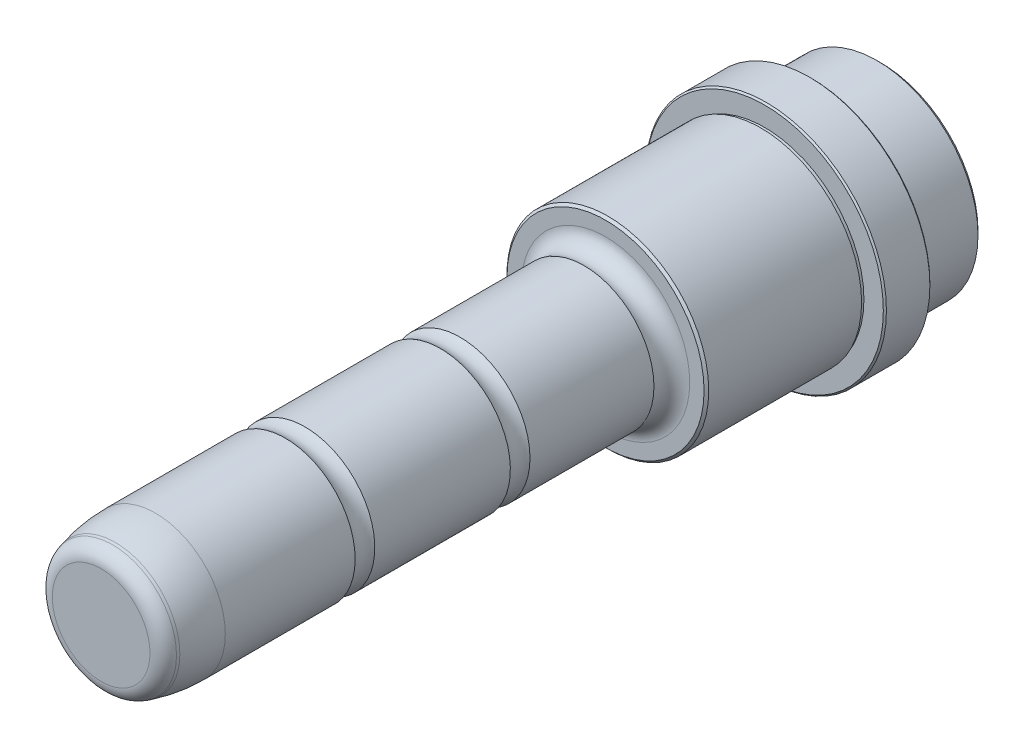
ISO-10303-21;
HEADER;
FILE_DESCRIPTION(('STEP AP214'),'2;1');
FILE_NAME('part.step','',(''),(''),'','','');
FILE_SCHEMA(('AUTOMOTIVE_DESIGN { 1 0 10303 214 1 1 1 1 }'));
ENDSEC;
DATA;
#1=APPLICATION_CONTEXT('core data for automotive mechanical design processes');
#2=APPLICATION_PROTOCOL_DEFINITION('international standard','automotive_design',2000,#1);
#3=PRODUCT_CONTEXT('',#1,'mechanical');
#4=PRODUCT('Part','Part','',(#3));
#5=PRODUCT_RELATED_PRODUCT_CATEGORY('part','',(#4));
#6=PRODUCT_DEFINITION_FORMATION('','',#4);
#7=PRODUCT_DEFINITION_CONTEXT('part definition',#1,'design');
#8=PRODUCT_DEFINITION('design','',#6,#7);
#9=PRODUCT_DEFINITION_SHAPE('','',#8);
#10=(LENGTH_UNIT() NAMED_UNIT(*) SI_UNIT(.MILLI.,.METRE.));
#11=(NAMED_UNIT(*) PLANE_ANGLE_UNIT() SI_UNIT($,.RADIAN.));
#12=(NAMED_UNIT(*) SI_UNIT($,.STERADIAN.) SOLID_ANGLE_UNIT());
#13=UNCERTAINTY_MEASURE_WITH_UNIT(LENGTH_MEASURE(1.E-05),#10,'distance_accuracy_value','');
#14=(GEOMETRIC_REPRESENTATION_CONTEXT(3) GLOBAL_UNCERTAINTY_ASSIGNED_CONTEXT((#13)) GLOBAL_UNIT_ASSIGNED_CONTEXT((#10,
#11,#12)) REPRESENTATION_CONTEXT('',''));
#15=CARTESIAN_POINT('',(0.,0.,0.));
#16=DIRECTION('',(0.,0.,1.));
#17=DIRECTION('',(1.,0.,0.));
#18=AXIS2_PLACEMENT_3D('',#15,#16,#17);
#19=CARTESIAN_POINT('',(0.,0.,-8.74999999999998));
#20=DIRECTION('',(0.,0.,1.));
#21=DIRECTION('',(1.,0.,0.));
#22=AXIS2_PLACEMENT_3D('',#19,#20,#21);
#23=CYLINDRICAL_SURFACE('',#22,9.);
#24=CARTESIAN_POINT('',(0.,0.,29.5099342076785));
#25=DIRECTION('',(0.,0.,1.));
#26=DIRECTION('',(1.,0.,0.));
#27=AXIS2_PLACEMENT_3D('',#24,#25,#26);
#28=CIRCLE('',#27,9.);
#29=CARTESIAN_POINT('',(9.,0.,29.5099342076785));
#30=VERTEX_POINT('',#29);
#31=EDGE_CURVE('E10',#30,#30,#28,.T.);
#32=ORIENTED_EDGE('',*,*,#31,.T.);
#33=EDGE_LOOP('',(#32));
#34=FACE_BOUND('',#33,.T.);
#35=CARTESIAN_POINT('',(0.,0.,45.4850889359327));
#36=DIRECTION('',(0.,0.,1.));
#37=DIRECTION('',(0.,-1.,0.));
#38=AXIS2_PLACEMENT_3D('',#35,#36,#37);
#39=CIRCLE('',#38,9.);
#40=CARTESIAN_POINT('',(0.,-9.,45.4850889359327));
#41=VERTEX_POINT('',#40);
#42=EDGE_CURVE('E106',#41,#41,#39,.T.);
#43=ORIENTED_EDGE('',*,*,#42,.F.);
#44=EDGE_LOOP('',(#43));
#45=FACE_BOUND('',#44,.T.);
#46=ADVANCED_FACE('F32',(#34,#45),#23,.T.);
#47=CARTESIAN_POINT('',(0.,0.,28.75));
#48=DIRECTION('',(0.,0.,1.));
#49=DIRECTION('',(1.,0.,0.));
#50=AXIS2_PLACEMENT_3D('',#47,#48,#49);
#51=TOROIDAL_SURFACE('',#50,10.85,2.);
#52=ORIENTED_EDGE('',*,*,#31,.F.);
#53=EDGE_LOOP('',(#52));
#54=FACE_BOUND('',#53,.T.);
#55=CARTESIAN_POINT('',(0.,0.,26.75));
#56=DIRECTION('',(0.,0.,1.));
#57=DIRECTION('',(1.,0.,0.));
#58=AXIS2_PLACEMENT_3D('',#55,#56,#57);
#59=CIRCLE('',#58,10.85);
#60=CARTESIAN_POINT('',(10.85,0.,26.75));
#61=VERTEX_POINT('',#60);
#62=EDGE_CURVE('E97',#61,#61,#59,.T.);
#63=ORIENTED_EDGE('',*,*,#62,.T.);
#64=EDGE_LOOP('',(#63));
#65=FACE_BOUND('',#64,.T.);
#66=ADVANCED_FACE('F34',(#54,#65),#51,.F.);
#67=CARTESIAN_POINT('',(0.,0.,-8.74999999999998));
#68=DIRECTION('',(0.,0.,1.));
#69=DIRECTION('',(1.,0.,0.));
#70=AXIS2_PLACEMENT_3D('',#67,#68,#69);
#71=PLANE('',#70);
#72=CARTESIAN_POINT('',(0.,0.,-8.74999999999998));
#73=DIRECTION('',(0.,0.,1.));
#74=DIRECTION('',(1.,0.,0.));
#75=AXIS2_PLACEMENT_3D('',#72,#73,#74);
#76=CIRCLE('',#75,12.5);
#77=CARTESIAN_POINT('',(12.5,0.,-8.74999999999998));
#78=VERTEX_POINT('',#77);
#79=EDGE_CURVE('E55',#78,#78,#76,.T.);
#80=ORIENTED_EDGE('',*,*,#79,.F.);
#81=EDGE_LOOP('',(#80));
#82=FACE_BOUND('',#81,.T.);
#83=ADVANCED_FACE('F137',(#82),#71,.F.);
#84=CARTESIAN_POINT('',(0.,0.,-8.74999999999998));
#85=DIRECTION('',(0.,0.,1.));
#86=DIRECTION('',(1.,0.,0.));
#87=AXIS2_PLACEMENT_3D('',#84,#85,#86);
#88=CONICAL_SURFACE('',#87,12.5,0.785398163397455);
#89=CARTESIAN_POINT('',(0.,0.,-8.24999999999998));
#90=DIRECTION('',(0.,0.,1.));
#91=DIRECTION('',(1.,0.,0.));
#92=AXIS2_PLACEMENT_3D('',#89,#90,#91);
#93=CIRCLE('',#92,13.);
#94=CARTESIAN_POINT('',(13.,0.,-8.24999999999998));
#95=VERTEX_POINT('',#94);
#96=EDGE_CURVE('E58',#95,#95,#93,.T.);
#97=ORIENTED_EDGE('',*,*,#96,.F.);
#98=EDGE_LOOP('',(#97));
#99=FACE_BOUND('',#98,.T.);
#100=ORIENTED_EDGE('',*,*,#79,.T.);
#101=EDGE_LOOP('',(#100));
#102=FACE_BOUND('',#101,.T.);
#103=ADVANCED_FACE('F204',(#99,#102),#88,.T.);
#104=CARTESIAN_POINT('',(0.,0.,-8.74999999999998));
#105=DIRECTION('',(0.,0.,1.));
#106=DIRECTION('',(1.,0.,0.));
#107=AXIS2_PLACEMENT_3D('',#104,#105,#106);
#108=CYLINDRICAL_SURFACE('',#107,13.);
#109=CARTESIAN_POINT('',(0.,0.,-0.249999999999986));
#110=DIRECTION('',(0.,0.,1.));
#111=DIRECTION('',(1.,0.,0.));
#112=AXIS2_PLACEMENT_3D('',#109,#110,#111);
#113=CIRCLE('',#112,13.);
#114=CARTESIAN_POINT('',(13.,0.,-0.249999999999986));
#115=VERTEX_POINT('',#114);
#116=EDGE_CURVE('E61',#115,#115,#113,.T.);
#117=ORIENTED_EDGE('',*,*,#116,.F.);
#118=EDGE_LOOP('',(#117));
#119=FACE_BOUND('',#118,.T.);
#120=ORIENTED_EDGE('',*,*,#96,.T.);
#121=EDGE_LOOP('',(#120));
#122=FACE_BOUND('',#121,.T.);
#123=ADVANCED_FACE('F200',(#119,#122),#108,.T.);
#124=CARTESIAN_POINT('',(0.,13.,-0.249999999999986));
#125=DIRECTION('',(0.,0.,-1.));
#126=DIRECTION('',(-1.,0.,0.));
#127=AXIS2_PLACEMENT_3D('',#124,#125,#126);
#128=PLANE('',#127);
#129=CARTESIAN_POINT('',(0.,0.,-0.249999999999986));
#130=DIRECTION('',(0.,0.,1.));
#131=DIRECTION('',(1.,0.,0.));
#132=AXIS2_PLACEMENT_3D('',#129,#130,#131);
#133=CIRCLE('',#132,12.8);
#134=CARTESIAN_POINT('',(12.8,0.,-0.249999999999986));
#135=VERTEX_POINT('',#134);
#136=EDGE_CURVE('E64',#135,#135,#133,.T.);
#137=ORIENTED_EDGE('',*,*,#136,.F.);
#138=EDGE_LOOP('',(#137));
#139=FACE_BOUND('',#138,.T.);
#140=ORIENTED_EDGE('',*,*,#116,.T.);
#141=EDGE_LOOP('',(#140));
#142=FACE_BOUND('',#141,.T.);
#143=ADVANCED_FACE('F196',(#139,#142),#128,.F.);
#144=CARTESIAN_POINT('',(0.,0.,-8.74999999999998));
#145=DIRECTION('',(0.,0.,1.));
#146=DIRECTION('',(1.,0.,0.));
#147=AXIS2_PLACEMENT_3D('',#144,#145,#146);
#148=CYLINDRICAL_SURFACE('',#147,12.8);
#149=CARTESIAN_POINT('',(0.,0.,0.250000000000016));
#150=DIRECTION('',(0.,0.,1.));
#151=DIRECTION('',(1.,0.,0.));
#152=AXIS2_PLACEMENT_3D('',#149,#150,#151);
#153=CIRCLE('',#152,12.8);
#154=CARTESIAN_POINT('',(12.8,0.,0.250000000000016));
#155=VERTEX_POINT('',#154);
#156=EDGE_CURVE('E67',#155,#155,#153,.T.);
#157=ORIENTED_EDGE('',*,*,#156,.F.);
#158=EDGE_LOOP('',(#157));
#159=FACE_BOUND('',#158,.T.);
#160=ORIENTED_EDGE('',*,*,#136,.T.);
#161=EDGE_LOOP('',(#160));
#162=FACE_BOUND('',#161,.T.);
#163=ADVANCED_FACE('F192',(#159,#162),#148,.T.);
#164=CARTESIAN_POINT('',(0.,12.8,0.250000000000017));
#165=DIRECTION('',(0.,0.,1.));
#166=DIRECTION('',(1.,0.,0.));
#167=AXIS2_PLACEMENT_3D('',#164,#165,#166);
#168=PLANE('',#167);
#169=CARTESIAN_POINT('',(0.,0.,0.250000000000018));
#170=DIRECTION('',(0.,0.,1.));
#171=DIRECTION('',(1.,0.,0.));
#172=AXIS2_PLACEMENT_3D('',#169,#170,#171);
#173=CIRCLE('',#172,15.3);
#174=CARTESIAN_POINT('',(15.3,0.,0.250000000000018));
#175=VERTEX_POINT('',#174);
#176=EDGE_CURVE('E70',#175,#175,#173,.T.);
#177=ORIENTED_EDGE('',*,*,#176,.F.);
#178=EDGE_LOOP('',(#177));
#179=FACE_BOUND('',#178,.T.);
#180=ORIENTED_EDGE('',*,*,#156,.T.);
#181=EDGE_LOOP('',(#180));
#182=FACE_BOUND('',#181,.T.);
#183=ADVANCED_FACE('F188',(#179,#182),#168,.F.);
#184=CARTESIAN_POINT('',(0.,0.,0.250000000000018));
#185=DIRECTION('',(0.,0.,1.));
#186=DIRECTION('',(1.,0.,0.));
#187=AXIS2_PLACEMENT_3D('',#184,#185,#186);
#188=CONICAL_SURFACE('',#187,15.3,0.785398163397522);
#189=CARTESIAN_POINT('',(0.,0.,0.450000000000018));
#190=DIRECTION('',(0.,0.,1.));
#191=DIRECTION('',(1.,0.,0.));
#192=AXIS2_PLACEMENT_3D('',#189,#190,#191);
#193=CIRCLE('',#192,15.5);
#194=CARTESIAN_POINT('',(15.5,0.,0.450000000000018));
#195=VERTEX_POINT('',#194);
#196=EDGE_CURVE('E73',#195,#195,#193,.T.);
#197=ORIENTED_EDGE('',*,*,#196,.F.);
#198=EDGE_LOOP('',(#197));
#199=FACE_BOUND('',#198,.T.);
#200=ORIENTED_EDGE('',*,*,#176,.T.);
#201=EDGE_LOOP('',(#200));
#202=FACE_BOUND('',#201,.T.);
#203=ADVANCED_FACE('F184',(#199,#202),#188,.T.);
#204=CARTESIAN_POINT('',(0.,0.,-8.74999999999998));
#205=DIRECTION('',(0.,0.,1.));
#206=DIRECTION('',(1.,0.,0.));
#207=AXIS2_PLACEMENT_3D('',#204,#205,#206);
#208=CYLINDRICAL_SURFACE('',#207,15.5);
#209=CARTESIAN_POINT('',(0.,0.,6.05000000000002));
#210=DIRECTION('',(0.,0.,1.));
#211=DIRECTION('',(1.,0.,0.));
#212=AXIS2_PLACEMENT_3D('',#209,#210,#211);
#213=CIRCLE('',#212,15.5);
#214=CARTESIAN_POINT('',(15.5,0.,6.05000000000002));
#215=VERTEX_POINT('',#214);
#216=EDGE_CURVE('E76',#215,#215,#213,.T.);
#217=ORIENTED_EDGE('',*,*,#216,.F.);
#218=EDGE_LOOP('',(#217));
#219=FACE_BOUND('',#218,.T.);
#220=ORIENTED_EDGE('',*,*,#196,.T.);
#221=EDGE_LOOP('',(#220));
#222=FACE_BOUND('',#221,.T.);
#223=ADVANCED_FACE('F180',(#219,#222),#208,.T.);
#224=CARTESIAN_POINT('',(0.,0.,6.05000000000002));
#225=DIRECTION('',(0.,0.,-1.));
#226=DIRECTION('',(-1.,0.,0.));
#227=AXIS2_PLACEMENT_3D('',#224,#225,#226);
#228=CONICAL_SURFACE('',#227,15.5,0.785398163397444);
#229=CARTESIAN_POINT('',(0.,0.,6.25000000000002));
#230=DIRECTION('',(0.,0.,1.));
#231=DIRECTION('',(1.,0.,0.));
#232=AXIS2_PLACEMENT_3D('',#229,#230,#231);
#233=CIRCLE('',#232,15.3);
#234=CARTESIAN_POINT('',(15.3,0.,6.25000000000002));
#235=VERTEX_POINT('',#234);
#236=EDGE_CURVE('E79',#235,#235,#233,.T.);
#237=ORIENTED_EDGE('',*,*,#236,.F.);
#238=EDGE_LOOP('',(#237));
#239=FACE_BOUND('',#238,.T.);
#240=ORIENTED_EDGE('',*,*,#216,.T.);
#241=EDGE_LOOP('',(#240));
#242=FACE_BOUND('',#241,.T.);
#243=ADVANCED_FACE('F176',(#239,#242),#228,.T.);
#244=CARTESIAN_POINT('',(0.,15.3,6.25000000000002));
#245=DIRECTION('',(0.,0.,-1.));
#246=DIRECTION('',(-1.,0.,0.));
#247=AXIS2_PLACEMENT_3D('',#244,#245,#246);
#248=PLANE('',#247);
#249=CARTESIAN_POINT('',(0.,0.,6.25000000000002));
#250=DIRECTION('',(0.,0.,1.));
#251=DIRECTION('',(1.,0.,0.));
#252=AXIS2_PLACEMENT_3D('',#249,#250,#251);
#253=CIRCLE('',#252,12.8);
#254=CARTESIAN_POINT('',(12.8,0.,6.25000000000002));
#255=VERTEX_POINT('',#254);
#256=EDGE_CURVE('E82',#255,#255,#253,.T.);
#257=ORIENTED_EDGE('',*,*,#256,.F.);
#258=EDGE_LOOP('',(#257));
#259=FACE_BOUND('',#258,.T.);
#260=ORIENTED_EDGE('',*,*,#236,.T.);
#261=EDGE_LOOP('',(#260));
#262=FACE_BOUND('',#261,.T.);
#263=ADVANCED_FACE('F172',(#259,#262),#248,.F.);
#264=CARTESIAN_POINT('',(0.,0.,-8.74999999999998));
#265=DIRECTION('',(0.,0.,1.));
#266=DIRECTION('',(1.,0.,0.));
#267=AXIS2_PLACEMENT_3D('',#264,#265,#266);
#268=CYLINDRICAL_SURFACE('',#267,12.8);
#269=CARTESIAN_POINT('',(0.,0.,6.75000000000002));
#270=DIRECTION('',(0.,0.,1.));
#271=DIRECTION('',(1.,0.,0.));
#272=AXIS2_PLACEMENT_3D('',#269,#270,#271);
#273=CIRCLE('',#272,12.8);
#274=CARTESIAN_POINT('',(12.8,0.,6.75000000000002));
#275=VERTEX_POINT('',#274);
#276=EDGE_CURVE('E85',#275,#275,#273,.T.);
#277=ORIENTED_EDGE('',*,*,#276,.F.);
#278=EDGE_LOOP('',(#277));
#279=FACE_BOUND('',#278,.T.);
#280=ORIENTED_EDGE('',*,*,#256,.T.);
#281=EDGE_LOOP('',(#280));
#282=FACE_BOUND('',#281,.T.);
#283=ADVANCED_FACE('F168',(#279,#282),#268,.T.);
#284=CARTESIAN_POINT('',(0.,12.8,6.75000000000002));
#285=DIRECTION('',(0.,0.,1.));
#286=DIRECTION('',(1.,0.,0.));
#287=AXIS2_PLACEMENT_3D('',#284,#285,#286);
#288=PLANE('',#287);
#289=CARTESIAN_POINT('',(0.,0.,6.75000000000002));
#290=DIRECTION('',(0.,0.,1.));
#291=DIRECTION('',(1.,0.,0.));
#292=AXIS2_PLACEMENT_3D('',#289,#290,#291);
#293=CIRCLE('',#292,13.);
#294=CARTESIAN_POINT('',(13.,0.,6.75000000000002));
#295=VERTEX_POINT('',#294);
#296=EDGE_CURVE('E88',#295,#295,#293,.T.);
#297=ORIENTED_EDGE('',*,*,#296,.F.);
#298=EDGE_LOOP('',(#297));
#299=FACE_BOUND('',#298,.T.);
#300=ORIENTED_EDGE('',*,*,#276,.T.);
#301=EDGE_LOOP('',(#300));
#302=FACE_BOUND('',#301,.T.);
#303=ADVANCED_FACE('F164',(#299,#302),#288,.F.);
#304=CARTESIAN_POINT('',(0.,0.,-8.74999999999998));
#305=DIRECTION('',(0.,0.,1.));
#306=DIRECTION('',(1.,0.,0.));
#307=AXIS2_PLACEMENT_3D('',#304,#305,#306);
#308=CYLINDRICAL_SURFACE('',#307,13.);
#309=CARTESIAN_POINT('',(0.,0.,26.45));
#310=DIRECTION('',(0.,0.,1.));
#311=DIRECTION('',(1.,0.,0.));
#312=AXIS2_PLACEMENT_3D('',#309,#310,#311);
#313=CIRCLE('',#312,13.);
#314=CARTESIAN_POINT('',(13.,0.,26.45));
#315=VERTEX_POINT('',#314);
#316=EDGE_CURVE('E91',#315,#315,#313,.T.);
#317=ORIENTED_EDGE('',*,*,#316,.F.);
#318=EDGE_LOOP('',(#317));
#319=FACE_BOUND('',#318,.T.);
#320=ORIENTED_EDGE('',*,*,#296,.T.);
#321=EDGE_LOOP('',(#320));
#322=FACE_BOUND('',#321,.T.);
#323=ADVANCED_FACE('F160',(#319,#322),#308,.T.);
#324=CARTESIAN_POINT('',(0.,0.,26.45));
#325=DIRECTION('',(0.,0.,-1.));
#326=DIRECTION('',(-1.,0.,0.));
#327=AXIS2_PLACEMENT_3D('',#324,#325,#326);
#328=CONICAL_SURFACE('',#327,13.,0.785398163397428);
#329=CARTESIAN_POINT('',(0.,0.,26.75));
#330=DIRECTION('',(0.,0.,1.));
#331=DIRECTION('',(1.,0.,0.));
#332=AXIS2_PLACEMENT_3D('',#329,#330,#331);
#333=CIRCLE('',#332,12.7);
#334=CARTESIAN_POINT('',(12.7,0.,26.75));
#335=VERTEX_POINT('',#334);
#336=EDGE_CURVE('E94',#335,#335,#333,.T.);
#337=ORIENTED_EDGE('',*,*,#336,.F.);
#338=EDGE_LOOP('',(#337));
#339=FACE_BOUND('',#338,.T.);
#340=ORIENTED_EDGE('',*,*,#316,.T.);
#341=EDGE_LOOP('',(#340));
#342=FACE_BOUND('',#341,.T.);
#343=ADVANCED_FACE('F128',(#339,#342),#328,.T.);
#344=CARTESIAN_POINT('',(0.,12.7,26.75));
#345=DIRECTION('',(0.,0.,-1.));
#346=DIRECTION('',(-1.,0.,0.));
#347=AXIS2_PLACEMENT_3D('',#344,#345,#346);
#348=PLANE('',#347);
#349=ORIENTED_EDGE('',*,*,#62,.F.);
#350=EDGE_LOOP('',(#349));
#351=FACE_BOUND('',#350,.T.);
#352=ORIENTED_EDGE('',*,*,#336,.T.);
#353=EDGE_LOOP('',(#352));
#354=FACE_BOUND('',#353,.T.);
#355=ADVANCED_FACE('F118',(#351,#354),#348,.F.);
#356=CARTESIAN_POINT('',(0.,0.,46.75));
#357=DIRECTION('',(0.,0.,1.));
#358=DIRECTION('',(0.,-1.,0.));
#359=AXIS2_PLACEMENT_3D('',#356,#357,#358);
#360=TOROIDAL_SURFACE('',#359,10.8000000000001,2.20000000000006);
#361=ORIENTED_EDGE('',*,*,#42,.T.);
#362=EDGE_LOOP('',(#361));
#363=FACE_BOUND('',#362,.T.);
#364=CARTESIAN_POINT('',(0.,0.,48.0149110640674));
#365=DIRECTION('',(0.,0.,1.));
#366=DIRECTION('',(0.,-1.,0.));
#367=AXIS2_PLACEMENT_3D('',#364,#365,#366);
#368=CIRCLE('',#367,9.);
#369=CARTESIAN_POINT('',(0.,-9.,48.0149110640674));
#370=VERTEX_POINT('',#369);
#371=EDGE_CURVE('E109',#370,#370,#368,.T.);
#372=ORIENTED_EDGE('',*,*,#371,.F.);
#373=EDGE_LOOP('',(#372));
#374=FACE_BOUND('',#373,.T.);
#375=ADVANCED_FACE('F115',(#363,#374),#360,.F.);
#376=CARTESIAN_POINT('',(0.,6.29522528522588,91.75));
#377=DIRECTION('',(0.,0.,-1.));
#378=DIRECTION('',(-1.,0.,0.));
#379=AXIS2_PLACEMENT_3D('',#376,#377,#378);
#380=PLANE('',#379);
#381=CARTESIAN_POINT('',(0.,0.,91.75));
#382=DIRECTION('',(0.,0.,1.));
#383=DIRECTION('',(1.,0.,0.));
#384=AXIS2_PLACEMENT_3D('',#381,#382,#383);
#385=CIRCLE('',#384,6.29522528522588);
#386=CARTESIAN_POINT('',(6.29522528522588,0.,91.75));
#387=VERTEX_POINT('',#386);
#388=EDGE_CURVE('E52',#387,#387,#385,.T.);
#389=ORIENTED_EDGE('',*,*,#388,.T.);
#390=EDGE_LOOP('',(#389));
#391=FACE_BOUND('',#390,.T.);
#392=ADVANCED_FACE('F117',(#391),#380,.F.);
#393=CARTESIAN_POINT('',(0.,0.,89.75));
#394=DIRECTION('',(0.,0.,1.));
#395=DIRECTION('',(1.,0.,0.));
#396=AXIS2_PLACEMENT_3D('',#393,#394,#395);
#397=TOROIDAL_SURFACE('',#396,6.29522528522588,2.00000000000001);
#398=ORIENTED_EDGE('',*,*,#388,.F.);
#399=EDGE_LOOP('',(#398));
#400=FACE_BOUND('',#399,.T.);
#401=CARTESIAN_POINT('',(0.,0.,90.2676380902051));
#402=DIRECTION('',(0.,0.,1.));
#403=DIRECTION('',(1.,0.,0.));
#404=AXIS2_PLACEMENT_3D('',#401,#402,#403);
#405=CIRCLE('',#404,8.22707693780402);
#406=CARTESIAN_POINT('',(8.22707693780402,0.,90.2676380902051));
#407=VERTEX_POINT('',#406);
#408=EDGE_CURVE('E47',#407,#407,#405,.T.);
#409=ORIENTED_EDGE('',*,*,#408,.T.);
#410=EDGE_LOOP('',(#409));
#411=FACE_BOUND('',#410,.T.);
#412=ADVANCED_FACE('F125',(#400,#411),#397,.T.);
#413=CARTESIAN_POINT('',(0.,0.,89.9263809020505));
#414=DIRECTION('',(0.,0.,-1.));
#415=DIRECTION('',(-1.,0.,0.));
#416=AXIS2_PLACEMENT_3D('',#413,#414,#415);
#417=CONICAL_SURFACE('',#416,8.31851652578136,0.261799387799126);
#418=ORIENTED_EDGE('',*,*,#408,.F.);
#419=EDGE_LOOP('',(#418));
#420=FACE_BOUND('',#419,.T.);
#421=CARTESIAN_POINT('',(0.,0.,89.9263809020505));
#422=DIRECTION('',(0.,0.,1.));
#423=DIRECTION('',(1.,0.,0.));
#424=AXIS2_PLACEMENT_3D('',#421,#422,#423);
#425=CIRCLE('',#424,8.31851652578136);
#426=CARTESIAN_POINT('',(8.31851652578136,0.,89.9263809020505));
#427=VERTEX_POINT('',#426);
#428=EDGE_CURVE('E43',#427,#427,#425,.T.);
#429=ORIENTED_EDGE('',*,*,#428,.T.);
#430=EDGE_LOOP('',(#429));
#431=FACE_BOUND('',#430,.T.);
#432=ADVANCED_FACE('F214',(#420,#431),#417,.T.);
#433=CARTESIAN_POINT('',(0.,0.,84.75));
#434=DIRECTION('',(0.,0.,1.));
#435=DIRECTION('',(1.,0.,0.));
#436=AXIS2_PLACEMENT_3D('',#433,#434,#435);
#437=DEGENERATE_TOROIDAL_SURFACE('',#436,11.,20.,.F.);
#438=ORIENTED_EDGE('',*,*,#428,.F.);
#439=EDGE_LOOP('',(#438));
#440=FACE_BOUND('',#439,.T.);
#441=CARTESIAN_POINT('',(0.,0.,84.75));
#442=DIRECTION('',(0.,0.,1.));
#443=DIRECTION('',(1.,0.,0.));
#444=AXIS2_PLACEMENT_3D('',#441,#442,#443);
#445=CIRCLE('',#444,8.99999999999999);
#446=CARTESIAN_POINT('',(8.99999999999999,0.,84.75));
#447=VERTEX_POINT('',#446);
#448=EDGE_CURVE('E39',#447,#447,#445,.T.);
#449=ORIENTED_EDGE('',*,*,#448,.T.);
#450=EDGE_LOOP('',(#449));
#451=FACE_BOUND('',#450,.T.);
#452=ADVANCED_FACE('F143',(#440,#451),#437,.F.);
#453=ORIENTED_EDGE('',*,*,#448,.F.);
#454=EDGE_LOOP('',(#453));
#455=FACE_BOUND('',#454,.T.);
#456=CARTESIAN_POINT('',(0.,0.,68.0149110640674));
#457=DIRECTION('',(0.,0.,1.));
#458=DIRECTION('',(0.,-1.,0.));
#459=AXIS2_PLACEMENT_3D('',#456,#457,#458);
#460=CIRCLE('',#459,9.);
#461=CARTESIAN_POINT('',(0.,-9.,68.0149110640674));
#462=VERTEX_POINT('',#461);
#463=EDGE_CURVE('E103',#462,#462,#460,.T.);
#464=ORIENTED_EDGE('',*,*,#463,.T.);
#465=EDGE_LOOP('',(#464));
#466=FACE_BOUND('',#465,.T.);
#467=ADVANCED_FACE('F133',(#455,#466),#23,.T.);
#468=CARTESIAN_POINT('',(0.,0.,66.75));
#469=DIRECTION('',(0.,0.,1.));
#470=DIRECTION('',(0.,-1.,0.));
#471=AXIS2_PLACEMENT_3D('',#468,#469,#470);
#472=TOROIDAL_SURFACE('',#471,10.8000000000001,2.20000000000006);
#473=CARTESIAN_POINT('',(0.,0.,65.4850889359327));
#474=DIRECTION('',(0.,0.,1.));
#475=DIRECTION('',(0.,-1.,0.));
#476=AXIS2_PLACEMENT_3D('',#473,#474,#475);
#477=CIRCLE('',#476,9.);
#478=CARTESIAN_POINT('',(0.,-9.,65.4850889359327));
#479=VERTEX_POINT('',#478);
#480=EDGE_CURVE('E100',#479,#479,#477,.T.);
#481=ORIENTED_EDGE('',*,*,#480,.T.);
#482=EDGE_LOOP('',(#481));
#483=FACE_BOUND('',#482,.T.);
#484=ORIENTED_EDGE('',*,*,#463,.F.);
#485=EDGE_LOOP('',(#484));
#486=FACE_BOUND('',#485,.T.);
#487=ADVANCED_FACE('F142',(#483,#486),#472,.F.);
#488=ORIENTED_EDGE('',*,*,#480,.F.);
#489=EDGE_LOOP('',(#488));
#490=FACE_BOUND('',#489,.T.);
#491=ORIENTED_EDGE('',*,*,#371,.T.);
#492=EDGE_LOOP('',(#491));
#493=FACE_BOUND('',#492,.T.);
#494=ADVANCED_FACE('F113',(#490,#493),#23,.T.);
#495=CLOSED_SHELL('',(#46,#66,#83,#103,#123,#143,#163,#183,#203,#223,#243,#263,#283,#303,#323,
#343,#355,#375,#392,#412,#432,#452,#467,#487,#494));
#496=MANIFOLD_SOLID_BREP('B2',#495);
#497=ADVANCED_BREP_SHAPE_REPRESENTATION('',(#18,#496),#14);
#498=SHAPE_DEFINITION_REPRESENTATION(#9,#497);
ENDSEC;
END-ISO-10303-21;
